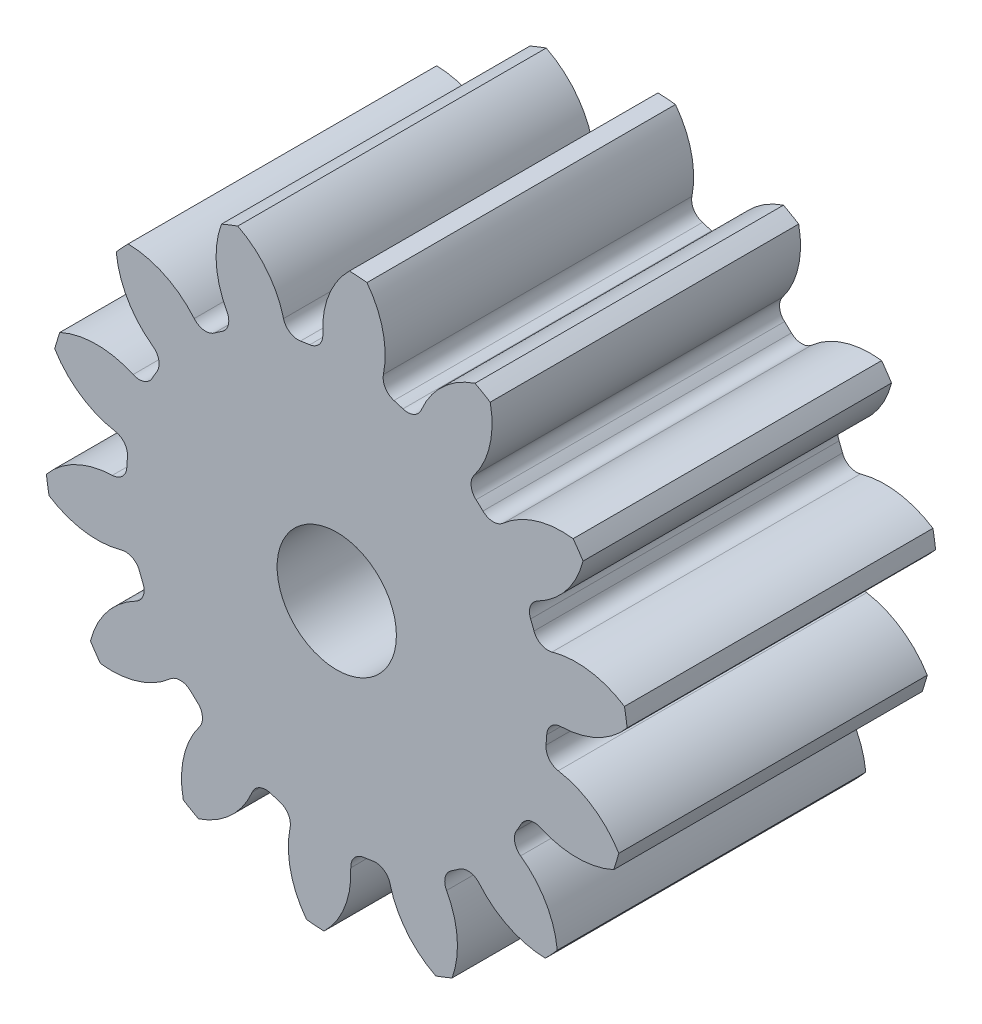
from build123d import *

# Parameters (mm, degrees)
SKETCH3_R         = 90.311111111
GEARBODY_DEPTH    = 95.25
TOOTHCUT_DEPTH    = 160.325942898
CIRPATTERN1_COUNT = 14
BOREDIA_R         = 18.415
BORE_DEPTH        = 12700


with BuildPart() as part:
    # Sketch3 → gearBody (new body)
    with BuildSketch(Plane.XY):
        Circle(SKETCH3_R)
    extrude(amount=GEARBODY_DEPTH)

    # Sketch2 → toothCut (cut, through all)
    with BuildSketch(Plane.XY):
        with BuildLine():
            ThreePointArc((64.613057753, -6.213301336), (64.735649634, -4.769487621), (64.825982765, -3.323297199))
            ThreePointArc((64.825982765, -3.323297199), (66.20799126, -0.267902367), (69.298127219, 1.034574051))
            ThreePointArc((69.298127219, 1.034574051), (81.011744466, 3.9971486), (90.311111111, 11.71125626))
            ThreePointArc((90.311111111, 11.71125626), (90.821120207, -6.691370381), (87.619580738, -24.820543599))
            ThreePointArc((87.619580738, -24.820543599), (79.551184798, -15.826842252), (68.398235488, -11.179542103))
            ThreePointArc((68.398235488, -11.179542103), (65.532353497, -9.438247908), (64.613057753, -6.213301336))
        make_face()
    toothcut = extrude(amount=TOOTHCUT_DEPTH, mode=Mode.SUBTRACT)

    # CirPattern1: toothCut ×14 about axis
    cirpattern1_axis = Axis((0, 0, 0), (0, 0, 1))
    for i in range(1, CIRPATTERN1_COUNT):
        add(toothcut.rotate(cirpattern1_axis, i * 360 / CIRPATTERN1_COUNT), mode=Mode.SUBTRACT)

    # boreDia → bore (cut, symmetric)
    with BuildSketch(Plane.XY):
        Circle(BOREDIA_R)
    extrude(amount=BORE_DEPTH, both=True, mode=Mode.SUBTRACT)


solid = part.part
